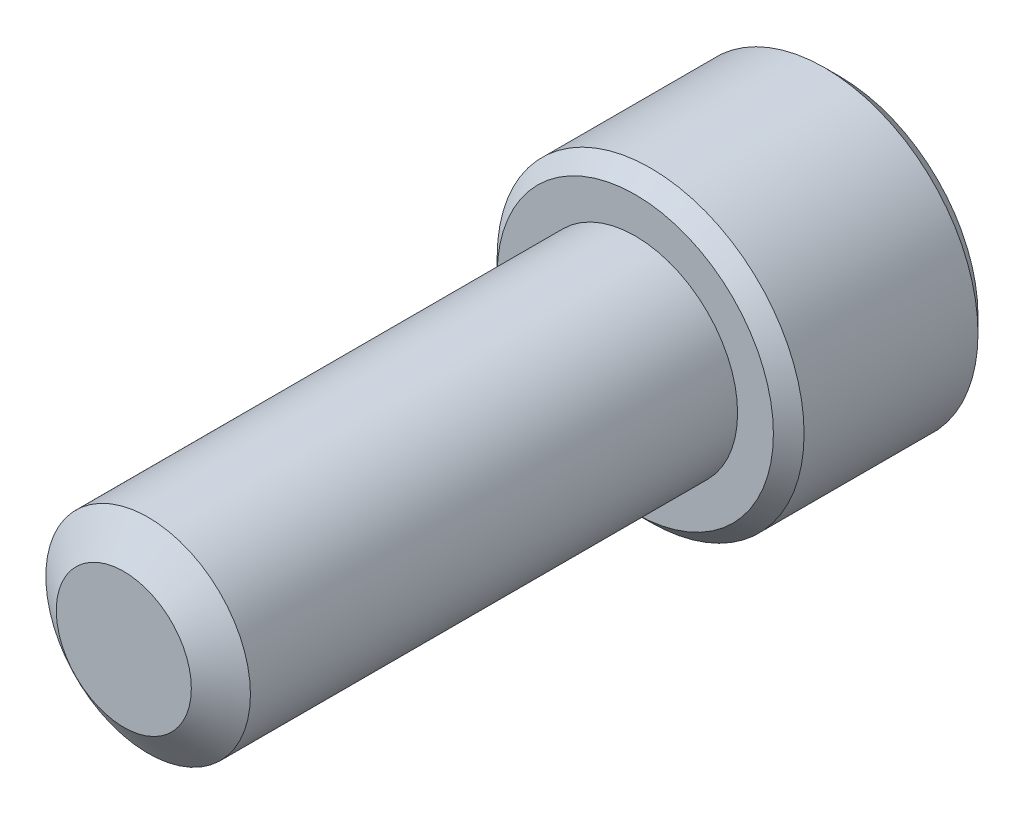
ISO-10303-21;
HEADER;
FILE_DESCRIPTION(('STEP AP214'),'2;1');
FILE_NAME('part.step','',(''),(''),'','','');
FILE_SCHEMA(('AUTOMOTIVE_DESIGN { 1 0 10303 214 1 1 1 1 }'));
ENDSEC;
DATA;
#1=APPLICATION_CONTEXT('core data for automotive mechanical design processes');
#2=APPLICATION_PROTOCOL_DEFINITION('international standard','automotive_design',2000,#1);
#3=PRODUCT_CONTEXT('',#1,'mechanical');
#4=PRODUCT('Part','Part','',(#3));
#5=PRODUCT_RELATED_PRODUCT_CATEGORY('part','',(#4));
#6=PRODUCT_DEFINITION_FORMATION('','',#4);
#7=PRODUCT_DEFINITION_CONTEXT('part definition',#1,'design');
#8=PRODUCT_DEFINITION('design','',#6,#7);
#9=PRODUCT_DEFINITION_SHAPE('','',#8);
#10=(LENGTH_UNIT() NAMED_UNIT(*) SI_UNIT(.MILLI.,.METRE.));
#11=(NAMED_UNIT(*) PLANE_ANGLE_UNIT() SI_UNIT($,.RADIAN.));
#12=(NAMED_UNIT(*) SI_UNIT($,.STERADIAN.) SOLID_ANGLE_UNIT());
#13=UNCERTAINTY_MEASURE_WITH_UNIT(LENGTH_MEASURE(1.E-05),#10,'distance_accuracy_value','');
#14=(GEOMETRIC_REPRESENTATION_CONTEXT(3) GLOBAL_UNCERTAINTY_ASSIGNED_CONTEXT((#13)) GLOBAL_UNIT_ASSIGNED_CONTEXT((#10,
#11,#12)) REPRESENTATION_CONTEXT('',''));
#15=CARTESIAN_POINT('',(0.,0.,0.));
#16=DIRECTION('',(0.,0.,1.));
#17=DIRECTION('',(1.,0.,0.));
#18=AXIS2_PLACEMENT_3D('',#15,#16,#17);
#19=CARTESIAN_POINT('',(0.,0.,-15.875));
#20=DIRECTION('',(0.,0.,1.));
#21=DIRECTION('',(1.,0.,0.));
#22=AXIS2_PLACEMENT_3D('',#19,#20,#21);
#23=CYLINDRICAL_SURFACE('',#22,3.175);
#24=CARTESIAN_POINT('',(0.,0.,-15.875));
#25=DIRECTION('',(0.,0.,-1.));
#26=DIRECTION('',(-1.,0.,0.));
#27=AXIS2_PLACEMENT_3D('',#24,#25,#26);
#28=CIRCLE('',#27,3.175);
#29=CARTESIAN_POINT('',(-3.175,0.,-15.875));
#30=VERTEX_POINT('',#29);
#31=EDGE_CURVE('E212',#30,#30,#28,.F.);
#32=ORIENTED_EDGE('',*,*,#31,.T.);
#33=EDGE_LOOP('',(#32));
#34=FACE_BOUND('',#33,.T.);
#35=CARTESIAN_POINT('',(0.,0.,-0.755446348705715));
#36=DIRECTION('',(0.,0.,1.));
#37=DIRECTION('',(1.,0.,0.));
#38=AXIS2_PLACEMENT_3D('',#35,#36,#37);
#39=CIRCLE('',#38,3.175);
#40=CARTESIAN_POINT('',(3.175,0.,-0.755446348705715));
#41=VERTEX_POINT('',#40);
#42=EDGE_CURVE('E109',#41,#41,#39,.T.);
#43=ORIENTED_EDGE('',*,*,#42,.F.);
#44=EDGE_LOOP('',(#43));
#45=FACE_BOUND('',#44,.T.);
#46=ADVANCED_FACE('F35',(#34,#45),#23,.T.);
#47=CARTESIAN_POINT('',(0.,0.,0.));
#48=DIRECTION('',(0.,0.,-1.));
#49=DIRECTION('',(-1.,0.,0.));
#50=AXIS2_PLACEMENT_3D('',#47,#48,#49);
#51=CONICAL_SURFACE('',#50,2.09611080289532,0.959931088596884);
#52=ORIENTED_EDGE('',*,*,#42,.T.);
#53=EDGE_LOOP('',(#52));
#54=FACE_BOUND('',#53,.T.);
#55=CARTESIAN_POINT('',(0.,0.,0.));
#56=DIRECTION('',(0.,0.,1.));
#57=DIRECTION('',(1.,0.,0.));
#58=AXIS2_PLACEMENT_3D('',#55,#56,#57);
#59=CIRCLE('',#58,2.09611080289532);
#60=CARTESIAN_POINT('',(2.09611080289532,0.,0.));
#61=VERTEX_POINT('',#60);
#62=EDGE_CURVE('E210',#61,#61,#59,.T.);
#63=ORIENTED_EDGE('',*,*,#62,.F.);
#64=EDGE_LOOP('',(#63));
#65=FACE_BOUND('',#64,.T.);
#66=ADVANCED_FACE('F193',(#54,#65),#51,.T.);
#67=CARTESIAN_POINT('',(0.,0.,0.));
#68=DIRECTION('',(0.,0.,1.));
#69=DIRECTION('',(1.,0.,0.));
#70=AXIS2_PLACEMENT_3D('',#67,#68,#69);
#71=PLANE('',#70);
#72=ORIENTED_EDGE('',*,*,#62,.T.);
#73=EDGE_LOOP('',(#72));
#74=FACE_BOUND('',#73,.T.);
#75=ADVANCED_FACE('F190',(#74),#71,.T.);
#76=CARTESIAN_POINT('',(0.,0.,-22.225));
#77=DIRECTION('',(0.,0.,1.));
#78=DIRECTION('',(1.,0.,0.));
#79=AXIS2_PLACEMENT_3D('',#76,#77,#78);
#80=CYLINDRICAL_SURFACE('',#79,4.7625);
#81=CARTESIAN_POINT('',(0.,0.,-21.74875));
#82=DIRECTION('',(0.,0.,-1.));
#83=DIRECTION('',(-1.,0.,0.));
#84=AXIS2_PLACEMENT_3D('',#81,#82,#83);
#85=CIRCLE('',#84,4.7625);
#86=CARTESIAN_POINT('',(4.7625,0.,-21.74875));
#87=VERTEX_POINT('',#86);
#88=EDGE_CURVE('E43',#87,#87,#85,.F.);
#89=CARTESIAN_POINT('',(0.,0.,-16.35125));
#90=DIRECTION('',(0.,0.,-1.));
#91=DIRECTION('',(-1.,0.,0.));
#92=AXIS2_PLACEMENT_3D('',#89,#90,#91);
#93=CIRCLE('',#92,4.7625);
#94=CARTESIAN_POINT('',(4.7625,0.,-16.35125));
#95=VERTEX_POINT('',#94);
#96=EDGE_CURVE('E169',#95,#95,#93,.T.);
#97=CARTESIAN_POINT('',(4.7625,0.,-21.74875));
#98=CARTESIAN_POINT('',(4.7625,0.,-21.6925260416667));
#99=CARTESIAN_POINT('',(4.7625,0.,-21.6363020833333));
#100=CARTESIAN_POINT('',(4.7625,0.,-21.5238541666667));
#101=CARTESIAN_POINT('',(4.7625,0.,-21.4676302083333));
#102=CARTESIAN_POINT('',(4.7625,0.,-21.3551822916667));
#103=CARTESIAN_POINT('',(4.7625,0.,-21.2989583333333));
#104=CARTESIAN_POINT('',(4.7625,0.,-21.1865104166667));
#105=CARTESIAN_POINT('',(4.7625,0.,-21.1302864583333));
#106=CARTESIAN_POINT('',(4.7625,0.,-21.0178385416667));
#107=CARTESIAN_POINT('',(4.7625,0.,-20.9616145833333));
#108=CARTESIAN_POINT('',(4.7625,0.,-20.8491666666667));
#109=CARTESIAN_POINT('',(4.7625,0.,-20.7929427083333));
#110=CARTESIAN_POINT('',(4.7625,0.,-20.6804947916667));
#111=CARTESIAN_POINT('',(4.7625,0.,-20.6242708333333));
#112=CARTESIAN_POINT('',(4.7625,0.,-20.5118229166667));
#113=CARTESIAN_POINT('',(4.7625,0.,-20.4555989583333));
#114=CARTESIAN_POINT('',(4.7625,0.,-20.3431510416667));
#115=CARTESIAN_POINT('',(4.7625,0.,-20.2869270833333));
#116=CARTESIAN_POINT('',(4.7625,0.,-20.1744791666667));
#117=CARTESIAN_POINT('',(4.7625,0.,-20.1182552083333));
#118=CARTESIAN_POINT('',(4.7625,0.,-20.0058072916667));
#119=CARTESIAN_POINT('',(4.7625,0.,-19.9495833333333));
#120=CARTESIAN_POINT('',(4.7625,0.,-19.8371354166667));
#121=CARTESIAN_POINT('',(4.7625,0.,-19.7809114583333));
#122=CARTESIAN_POINT('',(4.7625,0.,-19.6684635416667));
#123=CARTESIAN_POINT('',(4.7625,0.,-19.6122395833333));
#124=CARTESIAN_POINT('',(4.7625,0.,-19.4997916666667));
#125=CARTESIAN_POINT('',(4.7625,0.,-19.4435677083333));
#126=CARTESIAN_POINT('',(4.7625,0.,-19.3311197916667));
#127=CARTESIAN_POINT('',(4.7625,0.,-19.2748958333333));
#128=CARTESIAN_POINT('',(4.7625,0.,-19.1624479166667));
#129=CARTESIAN_POINT('',(4.7625,0.,-19.1062239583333));
#130=CARTESIAN_POINT('',(4.7625,0.,-18.9937760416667));
#131=CARTESIAN_POINT('',(4.7625,0.,-18.9375520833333));
#132=CARTESIAN_POINT('',(4.7625,0.,-18.8251041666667));
#133=CARTESIAN_POINT('',(4.7625,0.,-18.7688802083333));
#134=CARTESIAN_POINT('',(4.7625,0.,-18.6564322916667));
#135=CARTESIAN_POINT('',(4.7625,0.,-18.6002083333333));
#136=CARTESIAN_POINT('',(4.7625,0.,-18.4877604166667));
#137=CARTESIAN_POINT('',(4.7625,0.,-18.4315364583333));
#138=CARTESIAN_POINT('',(4.7625,0.,-18.3190885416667));
#139=CARTESIAN_POINT('',(4.7625,0.,-18.2628645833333));
#140=CARTESIAN_POINT('',(4.7625,0.,-18.1504166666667));
#141=CARTESIAN_POINT('',(4.7625,0.,-18.0941927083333));
#142=CARTESIAN_POINT('',(4.7625,0.,-17.9817447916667));
#143=CARTESIAN_POINT('',(4.7625,0.,-17.9255208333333));
#144=CARTESIAN_POINT('',(4.7625,0.,-17.8130729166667));
#145=CARTESIAN_POINT('',(4.7625,0.,-17.7568489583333));
#146=CARTESIAN_POINT('',(4.7625,0.,-17.6444010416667));
#147=CARTESIAN_POINT('',(4.7625,0.,-17.5881770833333));
#148=CARTESIAN_POINT('',(4.7625,0.,-17.4757291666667));
#149=CARTESIAN_POINT('',(4.7625,0.,-17.4195052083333));
#150=CARTESIAN_POINT('',(4.7625,0.,-17.3070572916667));
#151=CARTESIAN_POINT('',(4.7625,0.,-17.2508333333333));
#152=CARTESIAN_POINT('',(4.7625,0.,-17.1383854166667));
#153=CARTESIAN_POINT('',(4.7625,0.,-17.0821614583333));
#154=CARTESIAN_POINT('',(4.7625,0.,-16.9697135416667));
#155=CARTESIAN_POINT('',(4.7625,0.,-16.9134895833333));
#156=CARTESIAN_POINT('',(4.7625,0.,-16.8010416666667));
#157=CARTESIAN_POINT('',(4.7625,0.,-16.7448177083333));
#158=CARTESIAN_POINT('',(4.7625,0.,-16.6323697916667));
#159=CARTESIAN_POINT('',(4.7625,0.,-16.5761458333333));
#160=CARTESIAN_POINT('',(4.7625,0.,-16.4636979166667));
#161=CARTESIAN_POINT('',(4.7625,0.,-16.4074739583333));
#162=CARTESIAN_POINT('',(4.7625,0.,-16.35125));
#163=B_SPLINE_CURVE_WITH_KNOTS('',3,(#97,#98,#99,#100,#101,#102,#103,#104,#105,#106,#107,#108,
#109,#110,#111,#112,#113,#114,#115,#116,#117,#118,#119,#120,#121,#122,#123,#124,#125,#126,#127,
#128,#129,#130,#131,#132,#133,#134,#135,#136,#137,#138,#139,#140,#141,#142,#143,#144,#145,#146,
#147,#148,#149,#150,#151,#152,#153,#154,#155,#156,#157,#158,#159,#160,#161,#162),.UNSPECIFIED.,
.F.,.F.,(4,2,2,2,2,2,2,2,2,2,2,2,2,2,2,2,2,2,2,2,2,2,2,2,2,2,2,2,2,2,2,2,4),(0.,
0.168671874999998,0.337343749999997,0.506015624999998,0.6746875,0.843359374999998,1.01203125,
1.180703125,1.349375,1.518046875,1.68671875,1.855390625,2.0240625,2.192734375,2.36140625,
2.530078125,2.69875,2.867421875,3.03609375,3.204765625,3.3734375,3.542109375,3.71078125,
3.879453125,4.048125,4.216796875,4.38546875,4.554140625,4.7228125,4.891484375,5.06015625,
5.228828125,5.3975),.UNSPECIFIED.);
#164=EDGE_CURVE('BSEAM174',#87,#95,#163,.T.);
#165=ORIENTED_EDGE('',*,*,#88,.T.);
#166=ORIENTED_EDGE('',*,*,#96,.T.);
#167=ORIENTED_EDGE('',*,*,#164,.T.);
#168=ORIENTED_EDGE('',*,*,#164,.F.);
#169=EDGE_LOOP('',(#165,#167,#166,#168));
#170=FACE_BOUND('',#169,.T.);
#171=ADVANCED_FACE('F174',(#170),#80,.T.);
#172=CARTESIAN_POINT('',(0.,0.,-22.225));
#173=DIRECTION('',(0.,0.,-1.));
#174=DIRECTION('',(-1.,0.,0.));
#175=AXIS2_PLACEMENT_3D('',#172,#173,#174);
#176=PLANE('',#175);
#177=CARTESIAN_POINT('',(0.,0.,-22.225));
#178=DIRECTION('',(0.,0.,-1.));
#179=DIRECTION('',(-1.,0.,0.));
#180=AXIS2_PLACEMENT_3D('',#177,#178,#179);
#181=CIRCLE('',#180,4.28625);
#182=CARTESIAN_POINT('',(4.28625,0.,-22.225));
#183=VERTEX_POINT('',#182);
#184=EDGE_CURVE('E108',#183,#183,#181,.T.);
#185=ORIENTED_EDGE('',*,*,#184,.T.);
#186=EDGE_LOOP('',(#185));
#187=FACE_BOUND('',#186,.T.);
#188=CARTESIAN_POINT('',(0.,0.,-22.225));
#189=DIRECTION('',(0.,0.,-1.));
#190=DIRECTION('',(-1.,0.,0.));
#191=AXIS2_PLACEMENT_3D('',#188,#189,#190);
#192=CIRCLE('',#191,2.74963065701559);
#193=CARTESIAN_POINT('',(-2.38125,1.37481532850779,-22.225));
#194=VERTEX_POINT('',#193);
#195=CARTESIAN_POINT('',(0.,2.74963065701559,-22.225));
#196=VERTEX_POINT('',#195);
#197=EDGE_CURVE('E89',#194,#196,#192,.T.);
#198=ORIENTED_EDGE('',*,*,#197,.F.);
#199=CARTESIAN_POINT('',(-2.38125,-1.3748153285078,-22.225));
#200=VERTEX_POINT('',#199);
#201=EDGE_CURVE('E49',#200,#194,#192,.T.);
#202=ORIENTED_EDGE('',*,*,#201,.F.);
#203=CARTESIAN_POINT('',(0.,-2.74963065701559,-22.225));
#204=VERTEX_POINT('',#203);
#205=EDGE_CURVE('E268',#204,#200,#192,.T.);
#206=ORIENTED_EDGE('',*,*,#205,.F.);
#207=CARTESIAN_POINT('',(2.38125,-1.3748153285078,-22.225));
#208=VERTEX_POINT('',#207);
#209=EDGE_CURVE('E56',#208,#204,#192,.T.);
#210=ORIENTED_EDGE('',*,*,#209,.F.);
#211=CARTESIAN_POINT('',(2.38125,1.3748153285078,-22.225));
#212=VERTEX_POINT('',#211);
#213=EDGE_CURVE('E130',#212,#208,#192,.T.);
#214=ORIENTED_EDGE('',*,*,#213,.F.);
#215=EDGE_CURVE('E98',#196,#212,#192,.T.);
#216=ORIENTED_EDGE('',*,*,#215,.F.);
#217=EDGE_LOOP('',(#198,#202,#206,#210,#214,#216));
#218=FACE_BOUND('',#217,.T.);
#219=ADVANCED_FACE('F129',(#187,#218),#176,.T.);
#220=CARTESIAN_POINT('',(0.,0.,-15.875));
#221=DIRECTION('',(0.,0.,-1.));
#222=DIRECTION('',(-1.,0.,0.));
#223=AXIS2_PLACEMENT_3D('',#220,#221,#222);
#224=PLANE('',#223);
#225=CARTESIAN_POINT('',(0.,0.,-15.875));
#226=DIRECTION('',(0.,0.,-1.));
#227=DIRECTION('',(-1.,0.,0.));
#228=AXIS2_PLACEMENT_3D('',#225,#226,#227);
#229=CIRCLE('',#228,4.28625);
#230=CARTESIAN_POINT('',(-4.28625,0.,-15.875));
#231=VERTEX_POINT('',#230);
#232=EDGE_CURVE('E11',#231,#231,#229,.F.);
#233=ORIENTED_EDGE('',*,*,#232,.T.);
#234=EDGE_LOOP('',(#233));
#235=FACE_BOUND('',#234,.T.);
#236=ORIENTED_EDGE('',*,*,#31,.F.);
#237=EDGE_LOOP('',(#236));
#238=FACE_BOUND('',#237,.T.);
#239=ADVANCED_FACE('F183',(#235,#238),#224,.F.);
#240=CARTESIAN_POINT('',(0.,0.,-22.225));
#241=DIRECTION('',(0.,0.,-1.));
#242=DIRECTION('',(-1.,0.,0.));
#243=AXIS2_PLACEMENT_3D('',#240,#241,#242);
#244=CONICAL_SURFACE('',#243,2.74963065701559,0.78539816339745);
#245=ORIENTED_EDGE('',*,*,#215,.T.);
#246=CARTESIAN_POINT('',(-0.000199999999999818,2.74974612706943,-22.2251154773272));
#247=CARTESIAN_POINT('',(0.0816567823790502,2.70248609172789,-22.1778948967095));
#248=CARTESIAN_POINT('',(0.16488233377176,2.65443579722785,-22.1334475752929));
#249=CARTESIAN_POINT('',(0.33458848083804,2.556455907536,-22.0520654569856));
#250=CARTESIAN_POINT('',(0.421085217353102,2.50651699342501,-22.0151759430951));
#251=CARTESIAN_POINT('',(0.595501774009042,2.40581754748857,-21.9519834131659));
#252=CARTESIAN_POINT('',(0.683377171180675,2.35508266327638,-21.9255215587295));
#253=CARTESIAN_POINT('',(0.861062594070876,2.25249593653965,-21.8847515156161));
#254=CARTESIAN_POINT('',(0.950867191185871,2.20064722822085,-21.8704128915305));
#255=CARTESIAN_POINT('',(1.10563960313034,2.11128933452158,-21.8574757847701));
#256=CARTESIAN_POINT('',(1.17040744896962,2.07389560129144,-21.8555606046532));
#257=CARTESIAN_POINT('',(1.29983727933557,1.99916925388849,-21.8587866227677));
#258=CARTESIAN_POINT('',(1.36449921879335,1.96183666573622,-21.8639302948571));
#259=CARTESIAN_POINT('',(1.4932125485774,1.88752399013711,-21.8809813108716));
#260=CARTESIAN_POINT('',(1.55726317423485,1.85054434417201,-21.8928962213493));
#261=CARTESIAN_POINT('',(1.68425683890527,1.77722451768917,-21.922835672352));
#262=CARTESIAN_POINT('',(1.74719996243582,1.74088428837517,-21.9408597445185));
#263=CARTESIAN_POINT('',(1.90842615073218,1.64780030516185,-21.9943688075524));
#264=CARTESIAN_POINT('',(2.00570949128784,1.59163374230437,-22.0338874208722));
#265=CARTESIAN_POINT('',(2.14875606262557,1.50904576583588,-22.1006003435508));
#266=CARTESIAN_POINT('',(2.19589628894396,1.4818293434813,-22.1240402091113));
#267=CARTESIAN_POINT('',(2.28930352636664,1.42790064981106,-22.1730566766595));
#268=CARTESIAN_POINT('',(2.33557105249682,1.40118808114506,-22.1986319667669));
#269=CARTESIAN_POINT('',(2.38145,1.37469985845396,-22.2251154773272));
#270=B_SPLINE_CURVE_WITH_KNOTS('',3,(#246,#247,#248,#249,#250,#251,#252,#253,#254,#255,#256,
#257,#258,#259,#260,#261,#262,#263,#264,#265,#266,#267,#268,#269),.UNSPECIFIED.,.F.,.F.,(4,2,2,
2,2,2,2,2,2,2,2,4),(0.,0.317196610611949,0.636241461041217,0.950218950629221,1.26340583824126,
1.48752413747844,1.71172100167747,1.93616888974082,2.16059957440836,2.51709639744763,
2.69486147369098,2.87251813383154),.UNSPECIFIED.);
#271=EDGE_CURVE('E103',#196,#212,#270,.T.);
#272=ORIENTED_EDGE('',*,*,#271,.F.);
#273=EDGE_LOOP('',(#245,#272));
#274=FACE_BOUND('',#273,.T.);
#275=ADVANCED_FACE('F104',(#274),#244,.F.);
#276=ORIENTED_EDGE('',*,*,#213,.T.);
#277=CARTESIAN_POINT('',(2.38125,-2.74194290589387,-23.1069808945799));
#278=CARTESIAN_POINT('',(2.38125,-2.6751796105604,-23.0565846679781));
#279=CARTESIAN_POINT('',(2.38125,-2.60804251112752,-23.0066755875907));
#280=CARTESIAN_POINT('',(2.38125,-2.47287325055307,-22.9080498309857));
#281=CARTESIAN_POINT('',(2.38125,-2.40484086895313,-22.8593334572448));
#282=CARTESIAN_POINT('',(2.38125,-2.26723593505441,-22.7629648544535));
#283=CARTESIAN_POINT('',(2.38125,-2.1976555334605,-22.7153237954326));
#284=CARTESIAN_POINT('',(2.38125,-2.05731367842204,-22.6218199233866));
#285=CARTESIAN_POINT('',(2.38125,-1.98655230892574,-22.5759569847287));
#286=CARTESIAN_POINT('',(2.38125,-1.83957751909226,-22.4838459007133));
#287=CARTESIAN_POINT('',(2.38125,-1.76328361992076,-22.4377255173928));
#288=CARTESIAN_POINT('',(2.38125,-1.6089135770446,-22.3485183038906));
#289=CARTESIAN_POINT('',(2.38125,-1.53083712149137,-22.3054320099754));
#290=CARTESIAN_POINT('',(2.38125,-1.37291620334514,-22.2232265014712));
#291=CARTESIAN_POINT('',(2.38125,-1.29307799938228,-22.1840953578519));
#292=CARTESIAN_POINT('',(2.38125,-1.13121425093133,-22.1106679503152));
#293=CARTESIAN_POINT('',(2.38125,-1.04918943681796,-22.0763700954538));
#294=CARTESIAN_POINT('',(2.38125,-0.889535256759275,-22.0163546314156));
#295=CARTESIAN_POINT('',(2.38125,-0.812083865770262,-21.990168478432));
#296=CARTESIAN_POINT('',(2.38125,-0.655316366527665,-21.9440097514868));
#297=CARTESIAN_POINT('',(2.38125,-0.576000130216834,-21.9240376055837));
#298=CARTESIAN_POINT('',(2.38125,-0.417295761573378,-21.8916821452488));
#299=CARTESIAN_POINT('',(2.38125,-0.337934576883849,-21.8791688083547));
#300=CARTESIAN_POINT('',(2.38125,-0.178363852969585,-21.8619738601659));
#301=CARTESIAN_POINT('',(2.38125,-0.0981544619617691,-21.8572909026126));
#302=CARTESIAN_POINT('',(2.38125,0.059418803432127,-21.8561044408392));
#303=CARTESIAN_POINT('',(2.38125,0.136780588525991,-21.8593110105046));
#304=CARTESIAN_POINT('',(2.38125,0.290840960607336,-21.8730870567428));
#305=CARTESIAN_POINT('',(2.38125,0.367539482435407,-21.8836572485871));
#306=CARTESIAN_POINT('',(2.38125,0.521017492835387,-21.9117628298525));
#307=CARTESIAN_POINT('',(2.38125,0.597774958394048,-21.9294167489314));
#308=CARTESIAN_POINT('',(2.38125,0.74960981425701,-21.9707513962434));
#309=CARTESIAN_POINT('',(2.38125,0.824687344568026,-21.9944316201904));
#310=CARTESIAN_POINT('',(2.38125,1.06107814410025,-22.077894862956));
#311=CARTESIAN_POINT('',(2.38125,1.2190478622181,-22.1471839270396));
#312=CARTESIAN_POINT('',(2.38125,1.45021000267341,-22.2626640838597));
#313=CARTESIAN_POINT('',(2.38125,1.52644290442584,-22.3031730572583));
#314=CARTESIAN_POINT('',(2.38125,1.67717618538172,-22.3873026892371));
#315=CARTESIAN_POINT('',(2.38125,1.75167687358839,-22.4309227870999));
#316=CARTESIAN_POINT('',(2.38125,1.89548152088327,-22.518412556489));
#317=CARTESIAN_POINT('',(2.38125,1.96485959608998,-22.5621617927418));
#318=CARTESIAN_POINT('',(2.38125,2.10242624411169,-22.6515011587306));
#319=CARTESIAN_POINT('',(2.38125,2.17061472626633,-22.697091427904));
#320=CARTESIAN_POINT('',(2.38125,2.30540317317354,-22.7894060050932));
#321=CARTESIAN_POINT('',(2.38125,2.37201154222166,-22.8361180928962));
#322=CARTESIAN_POINT('',(2.38125,2.50431800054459,-22.9307775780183));
#323=CARTESIAN_POINT('',(2.38125,2.57001633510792,-22.9787246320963));
#324=CARTESIAN_POINT('',(2.38125,2.63533378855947,-23.0271767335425));
#325=B_SPLINE_CURVE_WITH_KNOTS('',3,(#277,#278,#279,#280,#281,#282,#283,#284,#285,#286,#287,
#288,#289,#290,#291,#292,#293,#294,#295,#296,#297,#298,#299,#300,#301,#302,#303,#304,#305,#306,
#307,#308,#309,#310,#311,#312,#313,#314,#315,#316,#317,#318,#319,#320,#321,#322,#323,#324),
.UNSPECIFIED.,.F.,.F.,(4,2,2,2,2,2,2,2,2,2,2,2,2,2,2,2,2,2,2,2,2,2,2,4),(0.,0.250951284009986,
0.501965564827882,0.754924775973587,1.00786608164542,1.27526207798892,1.54270521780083,
1.80931602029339,2.07583885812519,2.32089852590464,2.56597507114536,2.80664400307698,
3.04727155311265,3.27918940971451,3.51112979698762,3.74712477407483,3.98310000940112,
4.49898139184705,4.75794323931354,5.01685853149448,5.26288960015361,5.50893933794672,
5.75299038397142,5.9969743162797),.UNSPECIFIED.);
#326=EDGE_CURVE('E97',#212,#208,#325,.F.);
#327=ORIENTED_EDGE('',*,*,#326,.F.);
#328=EDGE_LOOP('',(#276,#327));
#329=FACE_BOUND('',#328,.T.);
#330=ADVANCED_FACE('F274',(#329),#244,.F.);
#331=ORIENTED_EDGE('',*,*,#209,.T.);
#332=CARTESIAN_POINT('',(2.38145,-1.37469985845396,-22.2251154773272));
#333=CARTESIAN_POINT('',(2.29959321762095,-1.4219598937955,-22.1778948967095));
#334=CARTESIAN_POINT('',(2.21636766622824,-1.47001018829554,-22.1334475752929));
#335=CARTESIAN_POINT('',(2.04666151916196,-1.56799007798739,-22.0520654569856));
#336=CARTESIAN_POINT('',(1.9601647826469,-1.61792899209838,-22.0151759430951));
#337=CARTESIAN_POINT('',(1.78574822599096,-1.71862843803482,-21.9519834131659));
#338=CARTESIAN_POINT('',(1.69787282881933,-1.769363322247,-21.9255215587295));
#339=CARTESIAN_POINT('',(1.52018740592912,-1.87195004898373,-21.8847515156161));
#340=CARTESIAN_POINT('',(1.43038280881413,-1.92379875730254,-21.8704128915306));
#341=CARTESIAN_POINT('',(1.27561039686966,-2.01315665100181,-21.8574757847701));
#342=CARTESIAN_POINT('',(1.21084255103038,-2.05055038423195,-21.8555606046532));
#343=CARTESIAN_POINT('',(1.08141272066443,-2.1252767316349,-21.8587866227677));
#344=CARTESIAN_POINT('',(1.01675078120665,-2.16260931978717,-21.8639302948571));
#345=CARTESIAN_POINT('',(0.888037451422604,-2.23692199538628,-21.8809813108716));
#346=CARTESIAN_POINT('',(0.823986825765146,-2.27390164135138,-21.8928962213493));
#347=CARTESIAN_POINT('',(0.696993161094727,-2.34722146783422,-21.922835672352));
#348=CARTESIAN_POINT('',(0.634050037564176,-2.38356169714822,-21.9408597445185));
#349=CARTESIAN_POINT('',(0.472823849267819,-2.47664568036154,-21.9943688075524));
#350=CARTESIAN_POINT('',(0.37554050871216,-2.53281224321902,-22.0338874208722));
#351=CARTESIAN_POINT('',(0.232493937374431,-2.61540021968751,-22.1006003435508));
#352=CARTESIAN_POINT('',(0.185353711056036,-2.6426166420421,-22.1240402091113));
#353=CARTESIAN_POINT('',(0.0919464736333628,-2.69654533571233,-22.1730566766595));
#354=CARTESIAN_POINT('',(0.0456789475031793,-2.72325790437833,-22.1986319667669));
#355=CARTESIAN_POINT('',(-0.000199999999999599,-2.74974612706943,-22.2251154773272));
#356=B_SPLINE_CURVE_WITH_KNOTS('',3,(#332,#333,#334,#335,#336,#337,#338,#339,#340,#341,#342,
#343,#344,#345,#346,#347,#348,#349,#350,#351,#352,#353,#354,#355),.UNSPECIFIED.,.F.,.F.,(4,2,2,
2,2,2,2,2,2,2,2,4),(0.,0.31719661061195,0.636241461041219,0.950218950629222,1.26340583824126,
1.48752413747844,1.71172100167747,1.93616888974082,2.16059957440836,2.51709639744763,
2.69486147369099,2.87251813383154),.UNSPECIFIED.);
#357=EDGE_CURVE('E139',#208,#204,#356,.T.);
#358=ORIENTED_EDGE('',*,*,#357,.F.);
#359=EDGE_LOOP('',(#331,#358));
#360=FACE_BOUND('',#359,.T.);
#361=ADVANCED_FACE('F271',(#360),#244,.F.);
#362=ORIENTED_EDGE('',*,*,#205,.T.);
#363=CARTESIAN_POINT('',(0.000200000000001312,-2.74974612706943,-22.2251154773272));
#364=CARTESIAN_POINT('',(-0.0816567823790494,-2.70248609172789,-22.1778948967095));
#365=CARTESIAN_POINT('',(-0.164882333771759,-2.65443579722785,-22.1334475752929));
#366=CARTESIAN_POINT('',(-0.334588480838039,-2.556455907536,-22.0520654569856));
#367=CARTESIAN_POINT('',(-0.421085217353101,-2.50651699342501,-22.0151759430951));
#368=CARTESIAN_POINT('',(-0.595501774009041,-2.40581754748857,-21.9519834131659));
#369=CARTESIAN_POINT('',(-0.683377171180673,-2.35508266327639,-21.9255215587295));
#370=CARTESIAN_POINT('',(-0.861062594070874,-2.25249593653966,-21.8847515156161));
#371=CARTESIAN_POINT('',(-0.95086719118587,-2.20064722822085,-21.8704128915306));
#372=CARTESIAN_POINT('',(-1.10563960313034,-2.11128933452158,-21.8574757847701));
#373=CARTESIAN_POINT('',(-1.17040744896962,-2.07389560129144,-21.8555606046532));
#374=CARTESIAN_POINT('',(-1.29983727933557,-1.99916925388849,-21.8587866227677));
#375=CARTESIAN_POINT('',(-1.36449921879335,-1.96183666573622,-21.8639302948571));
#376=CARTESIAN_POINT('',(-1.4932125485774,-1.88752399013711,-21.8809813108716));
#377=CARTESIAN_POINT('',(-1.55726317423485,-1.85054434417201,-21.8928962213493));
#378=CARTESIAN_POINT('',(-1.68425683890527,-1.77722451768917,-21.922835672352));
#379=CARTESIAN_POINT('',(-1.74719996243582,-1.74088428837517,-21.9408597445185));
#380=CARTESIAN_POINT('',(-1.90842615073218,-1.64780030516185,-21.9943688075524));
#381=CARTESIAN_POINT('',(-2.00570949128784,-1.59163374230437,-22.0338874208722));
#382=CARTESIAN_POINT('',(-2.14875606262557,-1.50904576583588,-22.1006003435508));
#383=CARTESIAN_POINT('',(-2.19589628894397,-1.48182934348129,-22.1240402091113));
#384=CARTESIAN_POINT('',(-2.28930352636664,-1.42790064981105,-22.1730566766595));
#385=CARTESIAN_POINT('',(-2.33557105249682,-1.40118808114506,-22.1986319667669));
#386=CARTESIAN_POINT('',(-2.38145,-1.37469985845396,-22.2251154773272));
#387=B_SPLINE_CURVE_WITH_KNOTS('',3,(#363,#364,#365,#366,#367,#368,#369,#370,#371,#372,#373,
#374,#375,#376,#377,#378,#379,#380,#381,#382,#383,#384,#385,#386),.UNSPECIFIED.,.F.,.F.,(4,2,2,
2,2,2,2,2,2,2,2,4),(0.,0.317196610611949,0.636241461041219,0.950218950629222,1.26340583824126,
1.48752413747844,1.71172100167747,1.93616888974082,2.16059957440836,2.51709639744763,
2.69486147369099,2.87251813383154),.UNSPECIFIED.);
#388=EDGE_CURVE('E246',#204,#200,#387,.T.);
#389=ORIENTED_EDGE('',*,*,#388,.F.);
#390=EDGE_LOOP('',(#362,#389));
#391=FACE_BOUND('',#390,.T.);
#392=ADVANCED_FACE('F270',(#391),#244,.F.);
#393=ORIENTED_EDGE('',*,*,#201,.T.);
#394=CARTESIAN_POINT('',(-2.38125,-2.74194290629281,-23.1069808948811));
#395=CARTESIAN_POINT('',(-2.38125,-2.67517961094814,-23.0565846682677));
#396=CARTESIAN_POINT('',(-2.38125,-2.60804251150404,-23.0066755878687));
#397=CARTESIAN_POINT('',(-2.38125,-2.47287325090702,-22.9080498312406));
#398=CARTESIAN_POINT('',(-2.38125,-2.40484086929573,-22.8593334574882));
#399=CARTESIAN_POINT('',(-2.38125,-2.26723593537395,-22.7629648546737));
#400=CARTESIAN_POINT('',(-2.38125,-2.1976555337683,-22.7153237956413));
#401=CARTESIAN_POINT('',(-2.38125,-2.05731367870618,-22.6218199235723));
#402=CARTESIAN_POINT('',(-2.38125,-1.98655230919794,-22.575956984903));
#403=CARTESIAN_POINT('',(-2.38125,-1.83957751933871,-22.4838459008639));
#404=CARTESIAN_POINT('',(-2.38125,-1.76328362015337,-22.4377255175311));
#405=CARTESIAN_POINT('',(-2.38125,-1.60891357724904,-22.3485183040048));
#406=CARTESIAN_POINT('',(-2.38125,-1.53083712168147,-22.305432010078));
#407=CARTESIAN_POINT('',(-2.38125,-1.37291620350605,-22.2232265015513));
#408=CARTESIAN_POINT('',(-2.38125,-1.29307799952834,-22.1840953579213));
#409=CARTESIAN_POINT('',(-2.38125,-1.13121425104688,-22.1106679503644));
#410=CARTESIAN_POINT('',(-2.38125,-1.04918943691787,-22.0763700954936));
#411=CARTESIAN_POINT('',(-2.38125,-0.889535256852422,-22.0163546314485));
#412=CARTESIAN_POINT('',(-2.38125,-0.812083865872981,-21.9901684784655));
#413=CARTESIAN_POINT('',(-2.38125,-0.655316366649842,-21.9440097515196));
#414=CARTESIAN_POINT('',(-2.38125,-0.576000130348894,-21.9240376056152));
#415=CARTESIAN_POINT('',(-2.38125,-0.41729576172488,-21.8916821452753));
#416=CARTESIAN_POINT('',(-2.38125,-0.337934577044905,-21.8791688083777));
#417=CARTESIAN_POINT('',(-2.38125,-0.178363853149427,-21.8619738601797));
#418=CARTESIAN_POINT('',(-2.38125,-0.0981544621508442,-21.8572909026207));
#419=CARTESIAN_POINT('',(-2.38125,0.0594188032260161,-21.8561044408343));
#420=CARTESIAN_POINT('',(-2.38125,0.136780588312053,-21.8593110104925));
#421=CARTESIAN_POINT('',(-2.38125,0.290840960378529,-21.8730870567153));
#422=CARTESIAN_POINT('',(-2.38125,0.367539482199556,-21.8836572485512));
#423=CARTESIAN_POINT('',(-2.38125,0.521017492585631,-21.9117628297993));
#424=CARTESIAN_POINT('',(-2.38125,0.597774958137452,-21.9294167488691));
#425=CARTESIAN_POINT('',(-2.38125,0.749609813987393,-21.9707513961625));
#426=CARTESIAN_POINT('',(-2.38125,0.82468734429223,-21.9944316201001));
#427=CARTESIAN_POINT('',(-2.38125,1.0610781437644,-22.0778948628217));
#428=CARTESIAN_POINT('',(-2.38125,1.21904786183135,-22.1471839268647));
#429=CARTESIAN_POINT('',(-2.38125,1.45021000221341,-22.2626640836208));
#430=CARTESIAN_POINT('',(-2.38125,1.52644290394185,-22.3031730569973));
#431=CARTESIAN_POINT('',(-2.38125,1.67717618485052,-22.3873026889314));
#432=CARTESIAN_POINT('',(-2.38125,1.75167687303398,-22.4309227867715));
#433=CARTESIAN_POINT('',(-2.38125,1.89548152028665,-22.5184125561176));
#434=CARTESIAN_POINT('',(-2.38125,1.96485959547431,-22.56216179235));
#435=CARTESIAN_POINT('',(-2.38125,2.10242624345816,-22.6515011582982));
#436=CARTESIAN_POINT('',(-2.38125,2.17061472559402,-22.6970914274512));
#437=CARTESIAN_POINT('',(-2.38125,2.3054031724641,-22.7894060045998));
#438=CARTESIAN_POINT('',(-2.38125,2.37201154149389,-22.8361180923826));
#439=CARTESIAN_POINT('',(-2.38125,2.50431799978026,-22.9307775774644));
#440=CARTESIAN_POINT('',(-2.38125,2.57001633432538,-22.9787246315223));
#441=CARTESIAN_POINT('',(-2.38125,2.63533378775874,-23.0271767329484));
#442=B_SPLINE_CURVE_WITH_KNOTS('',3,(#394,#395,#396,#397,#398,#399,#400,#401,#402,#403,#404,
#405,#406,#407,#408,#409,#410,#411,#412,#413,#414,#415,#416,#417,#418,#419,#420,#421,#422,#423,
#424,#425,#426,#427,#428,#429,#430,#431,#432,#433,#434,#435,#436,#437,#438,#439,#440,#441),
.UNSPECIFIED.,.F.,.F.,(4,2,2,2,2,2,2,2,2,2,2,2,2,2,2,2,2,2,2,2,2,2,2,4),(0.,0.250951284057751,
0.501965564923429,0.754924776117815,1.00786608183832,1.2752620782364,1.54270521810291,
1.80931602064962,2.0758388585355,2.32089852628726,2.56597507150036,2.80664400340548,
3.04727155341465,3.27918940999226,3.51112979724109,3.74712477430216,3.98310000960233,
4.49898139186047,4.75794323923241,5.01685853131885,5.26288959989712,5.50893933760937,
5.7529903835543,5.99697431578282),.UNSPECIFIED.);
#443=EDGE_CURVE('E119',#200,#194,#442,.T.);
#444=ORIENTED_EDGE('',*,*,#443,.F.);
#445=EDGE_LOOP('',(#393,#444));
#446=FACE_BOUND('',#445,.T.);
#447=ADVANCED_FACE('F283',(#446),#244,.F.);
#448=ORIENTED_EDGE('',*,*,#197,.T.);
#449=CARTESIAN_POINT('',(-2.38145,1.37469985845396,-22.2251154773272));
#450=CARTESIAN_POINT('',(-2.29959321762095,1.4219598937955,-22.1778948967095));
#451=CARTESIAN_POINT('',(-2.21636766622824,1.47001018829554,-22.1334475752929));
#452=CARTESIAN_POINT('',(-2.04666151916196,1.56799007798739,-22.0520654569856));
#453=CARTESIAN_POINT('',(-1.9601647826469,1.61792899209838,-22.0151759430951));
#454=CARTESIAN_POINT('',(-1.78574822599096,1.71862843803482,-21.9519834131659));
#455=CARTESIAN_POINT('',(-1.69787282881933,1.769363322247,-21.9255215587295));
#456=CARTESIAN_POINT('',(-1.52018740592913,1.87195004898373,-21.8847515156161));
#457=CARTESIAN_POINT('',(-1.43038280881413,1.92379875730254,-21.8704128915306));
#458=CARTESIAN_POINT('',(-1.27561039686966,2.01315665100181,-21.8574757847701));
#459=CARTESIAN_POINT('',(-1.21084255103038,2.05055038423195,-21.8555606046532));
#460=CARTESIAN_POINT('',(-1.08141272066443,2.1252767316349,-21.8587866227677));
#461=CARTESIAN_POINT('',(-1.01675078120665,2.16260931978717,-21.8639302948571));
#462=CARTESIAN_POINT('',(-0.888037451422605,2.23692199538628,-21.8809813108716));
#463=CARTESIAN_POINT('',(-0.823986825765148,2.27390164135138,-21.8928962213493));
#464=CARTESIAN_POINT('',(-0.696993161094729,2.34722146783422,-21.922835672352));
#465=CARTESIAN_POINT('',(-0.634050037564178,2.38356169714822,-21.9408597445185));
#466=CARTESIAN_POINT('',(-0.47282384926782,2.47664568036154,-21.9943688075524));
#467=CARTESIAN_POINT('',(-0.375540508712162,2.53281224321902,-22.0338874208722));
#468=CARTESIAN_POINT('',(-0.232493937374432,2.61540021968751,-22.1006003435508));
#469=CARTESIAN_POINT('',(-0.185353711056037,2.64261664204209,-22.1240402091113));
#470=CARTESIAN_POINT('',(-0.0919464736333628,2.69654533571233,-22.1730566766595));
#471=CARTESIAN_POINT('',(-0.0456789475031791,2.72325790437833,-22.1986319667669));
#472=CARTESIAN_POINT('',(0.000199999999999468,2.74974612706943,-22.2251154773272));
#473=B_SPLINE_CURVE_WITH_KNOTS('',3,(#449,#450,#451,#452,#453,#454,#455,#456,#457,#458,#459,
#460,#461,#462,#463,#464,#465,#466,#467,#468,#469,#470,#471,#472),.UNSPECIFIED.,.F.,.F.,(4,2,2,
2,2,2,2,2,2,2,2,4),(0.,0.317196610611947,0.636241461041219,0.950218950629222,1.26340583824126,
1.48752413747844,1.71172100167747,1.93616888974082,2.16059957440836,2.51709639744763,
2.69486147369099,2.87251813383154),.UNSPECIFIED.);
#474=EDGE_CURVE('E93',#194,#196,#473,.T.);
#475=ORIENTED_EDGE('',*,*,#474,.F.);
#476=EDGE_LOOP('',(#448,#475));
#477=FACE_BOUND('',#476,.T.);
#478=ADVANCED_FACE('F91',(#477),#244,.F.);
#479=CARTESIAN_POINT('',(2.38125,4.12444598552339,-18.653125));
#480=DIRECTION('',(0.,0.,-1.));
#481=DIRECTION('',(-1.,0.,0.));
#482=AXIS2_PLACEMENT_3D('',#479,#480,#481);
#483=PLANE('',#482);
#484=DIRECTION('',(0.866025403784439,0.5,0.));
#485=VECTOR('',#484,1.);
#486=CARTESIAN_POINT('',(-2.38125,1.3748153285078,-18.653125));
#487=LINE('',#486,#485);
#488=CARTESIAN_POINT('',(-2.38125,1.3748153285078,-18.653125));
#489=VERTEX_POINT('',#488);
#490=CARTESIAN_POINT('',(0.,2.74963065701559,-18.653125));
#491=VERTEX_POINT('',#490);
#492=EDGE_CURVE('E118',#489,#491,#487,.T.);
#493=ORIENTED_EDGE('',*,*,#492,.T.);
#494=DIRECTION('',(0.866025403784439,-0.5,0.));
#495=VECTOR('',#494,1.);
#496=CARTESIAN_POINT('',(0.,2.74963065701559,-18.653125));
#497=LINE('',#496,#495);
#498=CARTESIAN_POINT('',(2.38125,1.3748153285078,-18.653125));
#499=VERTEX_POINT('',#498);
#500=EDGE_CURVE('E123',#491,#499,#497,.T.);
#501=ORIENTED_EDGE('',*,*,#500,.T.);
#502=DIRECTION('',(0.,-1.,0.));
#503=VECTOR('',#502,1.);
#504=CARTESIAN_POINT('',(2.38125,1.3748153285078,-18.653125));
#505=LINE('',#504,#503);
#506=CARTESIAN_POINT('',(2.38125,-1.3748153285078,-18.653125));
#507=VERTEX_POINT('',#506);
#508=EDGE_CURVE('E234',#499,#507,#505,.T.);
#509=ORIENTED_EDGE('',*,*,#508,.T.);
#510=DIRECTION('',(-0.866025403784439,-0.5,0.));
#511=VECTOR('',#510,1.);
#512=CARTESIAN_POINT('',(2.38125,-1.3748153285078,-18.653125));
#513=LINE('',#512,#511);
#514=CARTESIAN_POINT('',(0.,-2.74963065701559,-18.653125));
#515=VERTEX_POINT('',#514);
#516=EDGE_CURVE('E231',#507,#515,#513,.T.);
#517=ORIENTED_EDGE('',*,*,#516,.T.);
#518=DIRECTION('',(-0.866025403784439,0.5,0.));
#519=VECTOR('',#518,1.);
#520=CARTESIAN_POINT('',(0.,-2.74963065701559,-18.653125));
#521=LINE('',#520,#519);
#522=CARTESIAN_POINT('',(-2.38125,-1.3748153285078,-18.653125));
#523=VERTEX_POINT('',#522);
#524=EDGE_CURVE('E228',#515,#523,#521,.T.);
#525=ORIENTED_EDGE('',*,*,#524,.T.);
#526=DIRECTION('',(0.,1.,0.));
#527=VECTOR('',#526,1.);
#528=CARTESIAN_POINT('',(-2.38125,-1.3748153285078,-18.653125));
#529=LINE('',#528,#527);
#530=EDGE_CURVE('E126',#523,#489,#529,.T.);
#531=ORIENTED_EDGE('',*,*,#530,.T.);
#532=EDGE_LOOP('',(#493,#501,#509,#517,#525,#531));
#533=FACE_BOUND('',#532,.T.);
#534=ADVANCED_FACE('F158',(#533),#483,.T.);
#535=CARTESIAN_POINT('',(0.,2.74963065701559,-18.653125));
#536=DIRECTION('',(0.5,0.866025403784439,0.));
#537=DIRECTION('',(-0.866025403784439,0.5,0.));
#538=AXIS2_PLACEMENT_3D('',#535,#536,#537);
#539=PLANE('',#538);
#540=DIRECTION('',(0.,0.,-1.));
#541=VECTOR('',#540,1.);
#542=CARTESIAN_POINT('',(0.,2.74963065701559,-18.653125));
#543=LINE('',#542,#541);
#544=EDGE_CURVE('E115',#491,#196,#543,.T.);
#545=ORIENTED_EDGE('',*,*,#544,.T.);
#546=ORIENTED_EDGE('',*,*,#271,.T.);
#547=DIRECTION('',(0.,0.,-1.));
#548=VECTOR('',#547,1.);
#549=CARTESIAN_POINT('',(2.38125,1.3748153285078,-18.653125));
#550=LINE('',#549,#548);
#551=EDGE_CURVE('E125',#499,#212,#550,.T.);
#552=ORIENTED_EDGE('',*,*,#551,.F.);
#553=ORIENTED_EDGE('',*,*,#500,.F.);
#554=EDGE_LOOP('',(#545,#546,#552,#553));
#555=FACE_BOUND('',#554,.T.);
#556=ADVANCED_FACE('F121',(#555),#539,.F.);
#557=CARTESIAN_POINT('',(2.38125,1.3748153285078,-18.653125));
#558=DIRECTION('',(1.,0.,0.));
#559=DIRECTION('',(0.,0.,-1.));
#560=AXIS2_PLACEMENT_3D('',#557,#558,#559);
#561=PLANE('',#560);
#562=ORIENTED_EDGE('',*,*,#551,.T.);
#563=ORIENTED_EDGE('',*,*,#326,.T.);
#564=DIRECTION('',(0.,0.,-1.));
#565=VECTOR('',#564,1.);
#566=CARTESIAN_POINT('',(2.38125,-1.3748153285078,-18.653125));
#567=LINE('',#566,#565);
#568=EDGE_CURVE('E217',#507,#208,#567,.T.);
#569=ORIENTED_EDGE('',*,*,#568,.F.);
#570=ORIENTED_EDGE('',*,*,#508,.F.);
#571=EDGE_LOOP('',(#562,#563,#569,#570));
#572=FACE_BOUND('',#571,.T.);
#573=ADVANCED_FACE('F147',(#572),#561,.F.);
#574=CARTESIAN_POINT('',(2.38125,-1.3748153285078,-18.653125));
#575=DIRECTION('',(0.5,-0.866025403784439,0.));
#576=DIRECTION('',(0.866025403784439,0.5,0.));
#577=AXIS2_PLACEMENT_3D('',#574,#575,#576);
#578=PLANE('',#577);
#579=ORIENTED_EDGE('',*,*,#568,.T.);
#580=ORIENTED_EDGE('',*,*,#357,.T.);
#581=DIRECTION('',(0.,0.,-1.));
#582=VECTOR('',#581,1.);
#583=CARTESIAN_POINT('',(0.,-2.74963065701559,-18.653125));
#584=LINE('',#583,#582);
#585=EDGE_CURVE('E220',#515,#204,#584,.T.);
#586=ORIENTED_EDGE('',*,*,#585,.F.);
#587=ORIENTED_EDGE('',*,*,#516,.F.);
#588=EDGE_LOOP('',(#579,#580,#586,#587));
#589=FACE_BOUND('',#588,.T.);
#590=ADVANCED_FACE('F151',(#589),#578,.F.);
#591=CARTESIAN_POINT('',(0.,-2.74963065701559,-18.653125));
#592=DIRECTION('',(-0.5,-0.866025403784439,0.));
#593=DIRECTION('',(0.866025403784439,-0.5,0.));
#594=AXIS2_PLACEMENT_3D('',#591,#592,#593);
#595=PLANE('',#594);
#596=ORIENTED_EDGE('',*,*,#585,.T.);
#597=ORIENTED_EDGE('',*,*,#388,.T.);
#598=DIRECTION('',(0.,0.,-1.));
#599=VECTOR('',#598,1.);
#600=CARTESIAN_POINT('',(-2.38125,-1.3748153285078,-18.653125));
#601=LINE('',#600,#599);
#602=EDGE_CURVE('E223',#523,#200,#601,.T.);
#603=ORIENTED_EDGE('',*,*,#602,.F.);
#604=ORIENTED_EDGE('',*,*,#524,.F.);
#605=EDGE_LOOP('',(#596,#597,#603,#604));
#606=FACE_BOUND('',#605,.T.);
#607=ADVANCED_FACE('F253',(#606),#595,.F.);
#608=CARTESIAN_POINT('',(-2.38125,-1.3748153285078,-18.653125));
#609=DIRECTION('',(-1.,0.,0.));
#610=DIRECTION('',(0.,-1.,0.));
#611=AXIS2_PLACEMENT_3D('',#608,#609,#610);
#612=PLANE('',#611);
#613=ORIENTED_EDGE('',*,*,#602,.T.);
#614=ORIENTED_EDGE('',*,*,#443,.T.);
#615=DIRECTION('',(0.,0.,-1.));
#616=VECTOR('',#615,1.);
#617=CARTESIAN_POINT('',(-2.38125,1.3748153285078,-18.653125));
#618=LINE('',#617,#616);
#619=EDGE_CURVE('E117',#489,#194,#618,.T.);
#620=ORIENTED_EDGE('',*,*,#619,.F.);
#621=ORIENTED_EDGE('',*,*,#530,.F.);
#622=EDGE_LOOP('',(#613,#614,#620,#621));
#623=FACE_BOUND('',#622,.T.);
#624=ADVANCED_FACE('F250',(#623),#612,.F.);
#625=CARTESIAN_POINT('',(-2.38125,1.3748153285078,-18.653125));
#626=DIRECTION('',(-0.5,0.866025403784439,0.));
#627=DIRECTION('',(-0.866025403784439,-0.5,0.));
#628=AXIS2_PLACEMENT_3D('',#625,#626,#627);
#629=PLANE('',#628);
#630=ORIENTED_EDGE('',*,*,#619,.T.);
#631=ORIENTED_EDGE('',*,*,#474,.T.);
#632=ORIENTED_EDGE('',*,*,#544,.F.);
#633=ORIENTED_EDGE('',*,*,#492,.F.);
#634=EDGE_LOOP('',(#630,#631,#632,#633));
#635=FACE_BOUND('',#634,.T.);
#636=ADVANCED_FACE('F113',(#635),#629,.F.);
#637=CARTESIAN_POINT('',(0.,0.,-22.225));
#638=DIRECTION('',(0.,0.,1.));
#639=DIRECTION('',(1.,0.,0.));
#640=AXIS2_PLACEMENT_3D('',#637,#638,#639);
#641=CONICAL_SURFACE('',#640,4.28625,0.785398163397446);
#642=CARTESIAN_POINT('',(4.7625,0.,-21.74875));
#643=CARTESIAN_POINT('',(4.7575390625,0.,-21.7537109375));
#644=CARTESIAN_POINT('',(4.752578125,0.,-21.758671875));
#645=CARTESIAN_POINT('',(4.74265625,0.,-21.76859375));
#646=CARTESIAN_POINT('',(4.7376953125,0.,-21.7735546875));
#647=CARTESIAN_POINT('',(4.7277734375,0.,-21.7834765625));
#648=CARTESIAN_POINT('',(4.7228125,0.,-21.7884375));
#649=CARTESIAN_POINT('',(4.712890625,0.,-21.798359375));
#650=CARTESIAN_POINT('',(4.7079296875,0.,-21.8033203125));
#651=CARTESIAN_POINT('',(4.6980078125,0.,-21.8132421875));
#652=CARTESIAN_POINT('',(4.693046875,0.,-21.818203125));
#653=CARTESIAN_POINT('',(4.683125,0.,-21.828125));
#654=CARTESIAN_POINT('',(4.6781640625,0.,-21.8330859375));
#655=CARTESIAN_POINT('',(4.6682421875,0.,-21.8430078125));
#656=CARTESIAN_POINT('',(4.66328125,0.,-21.84796875));
#657=CARTESIAN_POINT('',(4.653359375,0.,-21.857890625));
#658=CARTESIAN_POINT('',(4.6483984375,0.,-21.8628515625));
#659=CARTESIAN_POINT('',(4.6384765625,0.,-21.8727734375));
#660=CARTESIAN_POINT('',(4.633515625,0.,-21.877734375));
#661=CARTESIAN_POINT('',(4.62359375,0.,-21.88765625));
#662=CARTESIAN_POINT('',(4.6186328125,0.,-21.8926171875));
#663=CARTESIAN_POINT('',(4.6087109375,0.,-21.9025390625));
#664=CARTESIAN_POINT('',(4.60375,0.,-21.9075));
#665=CARTESIAN_POINT('',(4.593828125,0.,-21.917421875));
#666=CARTESIAN_POINT('',(4.5888671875,0.,-21.9223828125));
#667=CARTESIAN_POINT('',(4.5789453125,0.,-21.9323046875));
#668=CARTESIAN_POINT('',(4.573984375,0.,-21.937265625));
#669=CARTESIAN_POINT('',(4.5640625,0.,-21.9471875));
#670=CARTESIAN_POINT('',(4.5591015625,0.,-21.9521484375));
#671=CARTESIAN_POINT('',(4.5491796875,0.,-21.9620703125));
#672=CARTESIAN_POINT('',(4.54421875,0.,-21.96703125));
#673=CARTESIAN_POINT('',(4.534296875,0.,-21.976953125));
#674=CARTESIAN_POINT('',(4.5293359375,0.,-21.9819140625));
#675=CARTESIAN_POINT('',(4.5194140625,0.,-21.9918359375));
#676=CARTESIAN_POINT('',(4.514453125,0.,-21.996796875));
#677=CARTESIAN_POINT('',(4.50453125,0.,-22.00671875));
#678=CARTESIAN_POINT('',(4.4995703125,0.,-22.0116796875));
#679=CARTESIAN_POINT('',(4.4896484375,0.,-22.0216015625));
#680=CARTESIAN_POINT('',(4.4846875,0.,-22.0265625));
#681=CARTESIAN_POINT('',(4.474765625,0.,-22.036484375));
#682=CARTESIAN_POINT('',(4.4698046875,0.,-22.0414453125));
#683=CARTESIAN_POINT('',(4.4598828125,0.,-22.0513671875));
#684=CARTESIAN_POINT('',(4.454921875,0.,-22.056328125));
#685=CARTESIAN_POINT('',(4.445,0.,-22.06625));
#686=CARTESIAN_POINT('',(4.4400390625,0.,-22.0712109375));
#687=CARTESIAN_POINT('',(4.4301171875,0.,-22.0811328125));
#688=CARTESIAN_POINT('',(4.42515625,0.,-22.08609375));
#689=CARTESIAN_POINT('',(4.415234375,0.,-22.096015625));
#690=CARTESIAN_POINT('',(4.4102734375,0.,-22.1009765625));
#691=CARTESIAN_POINT('',(4.4003515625,0.,-22.1108984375));
#692=CARTESIAN_POINT('',(4.395390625,0.,-22.115859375));
#693=CARTESIAN_POINT('',(4.38546875,0.,-22.12578125));
#694=CARTESIAN_POINT('',(4.3805078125,0.,-22.1307421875));
#695=CARTESIAN_POINT('',(4.3705859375,0.,-22.1406640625));
#696=CARTESIAN_POINT('',(4.365625,0.,-22.145625));
#697=CARTESIAN_POINT('',(4.355703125,0.,-22.155546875));
#698=CARTESIAN_POINT('',(4.3507421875,0.,-22.1605078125));
#699=CARTESIAN_POINT('',(4.3408203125,0.,-22.1704296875));
#700=CARTESIAN_POINT('',(4.335859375,0.,-22.175390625));
#701=CARTESIAN_POINT('',(4.3259375,0.,-22.1853125));
#702=CARTESIAN_POINT('',(4.3209765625,0.,-22.1902734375));
#703=CARTESIAN_POINT('',(4.3110546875,0.,-22.2001953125));
#704=CARTESIAN_POINT('',(4.30609375,0.,-22.20515625));
#705=CARTESIAN_POINT('',(4.296171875,0.,-22.215078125));
#706=CARTESIAN_POINT('',(4.2912109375,0.,-22.2200390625));
#707=CARTESIAN_POINT('',(4.28625,0.,-22.225));
#708=B_SPLINE_CURVE_WITH_KNOTS('',3,(#642,#643,#644,#645,#646,#647,#648,#649,#650,#651,#652,
#653,#654,#655,#656,#657,#658,#659,#660,#661,#662,#663,#664,#665,#666,#667,#668,#669,#670,#671,
#672,#673,#674,#675,#676,#677,#678,#679,#680,#681,#682,#683,#684,#685,#686,#687,#688,#689,#690,
#691,#692,#693,#694,#695,#696,#697,#698,#699,#700,#701,#702,#703,#704,#705,#706,#707),
.UNSPECIFIED.,.F.,.F.,(4,2,2,2,2,2,2,2,2,2,2,2,2,2,2,2,2,2,2,2,2,2,2,2,2,2,2,2,2,2,2,2,4),(0.,
0.0210474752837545,0.0420949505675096,0.0631424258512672,0.0841899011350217,0.105237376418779,
0.126284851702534,0.147332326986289,0.168379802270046,0.189427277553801,0.210474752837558,
0.231522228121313,0.252569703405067,0.273617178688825,0.294664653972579,0.315712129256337,
0.336759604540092,0.357807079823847,0.378854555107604,0.399902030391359,0.420949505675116,
0.441996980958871,0.463044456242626,0.484091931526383,0.505139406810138,0.526186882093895,
0.54723435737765,0.568281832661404,0.589329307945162,0.610376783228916,0.631424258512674,
0.652471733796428,0.673519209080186),.UNSPECIFIED.);
#709=EDGE_CURVE('BSEAM177',#87,#183,#708,.T.);
#710=ORIENTED_EDGE('',*,*,#88,.F.);
#711=ORIENTED_EDGE('',*,*,#184,.F.);
#712=ORIENTED_EDGE('',*,*,#709,.T.);
#713=ORIENTED_EDGE('',*,*,#709,.F.);
#714=EDGE_LOOP('',(#710,#712,#711,#713));
#715=FACE_BOUND('',#714,.T.);
#716=ADVANCED_FACE('F177',(#715),#641,.T.);
#717=CARTESIAN_POINT('',(0.,0.,-16.35125));
#718=DIRECTION('',(0.,0.,-1.));
#719=DIRECTION('',(-1.,0.,0.));
#720=AXIS2_PLACEMENT_3D('',#717,#718,#719);
#721=CONICAL_SURFACE('',#720,4.7625,0.785398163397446);
#722=ORIENTED_EDGE('',*,*,#232,.F.);
#723=EDGE_LOOP('',(#722));
#724=FACE_BOUND('',#723,.T.);
#725=ORIENTED_EDGE('',*,*,#96,.F.);
#726=EDGE_LOOP('',(#725));
#727=FACE_BOUND('',#726,.T.);
#728=ADVANCED_FACE('F37',(#724,#727),#721,.T.);
#729=CLOSED_SHELL('',(#46,#66,#75,#171,#219,#239,#275,#330,#361,#392,#447,#478,#534,#556,#573,
#590,#607,#624,#636,#716,#728));
#730=MANIFOLD_SOLID_BREP('B2',#729);
#731=ADVANCED_BREP_SHAPE_REPRESENTATION('',(#18,#730),#14);
#732=SHAPE_DEFINITION_REPRESENTATION(#9,#731);
ENDSEC;
END-ISO-10303-21;
